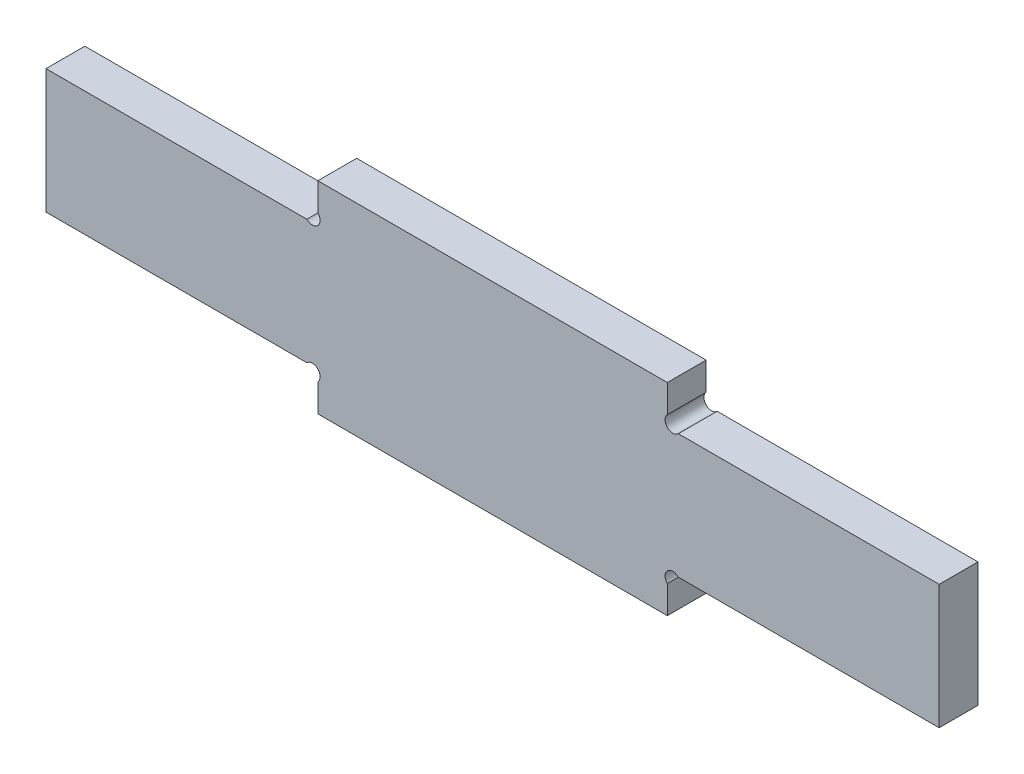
ISO-10303-21;
HEADER;
FILE_DESCRIPTION(('STEP AP214'),'2;1');
FILE_NAME('part.step','',(''),(''),'','','');
FILE_SCHEMA(('AUTOMOTIVE_DESIGN { 1 0 10303 214 1 1 1 1 }'));
ENDSEC;
DATA;
#1=APPLICATION_CONTEXT('core data for automotive mechanical design processes');
#2=APPLICATION_PROTOCOL_DEFINITION('international standard','automotive_design',2000,#1);
#3=PRODUCT_CONTEXT('',#1,'mechanical');
#4=PRODUCT('Part','Part','',(#3));
#5=PRODUCT_RELATED_PRODUCT_CATEGORY('part','',(#4));
#6=PRODUCT_DEFINITION_FORMATION('','',#4);
#7=PRODUCT_DEFINITION_CONTEXT('part definition',#1,'design');
#8=PRODUCT_DEFINITION('design','',#6,#7);
#9=PRODUCT_DEFINITION_SHAPE('','',#8);
#10=(LENGTH_UNIT() NAMED_UNIT(*) SI_UNIT(.MILLI.,.METRE.));
#11=(NAMED_UNIT(*) PLANE_ANGLE_UNIT() SI_UNIT($,.RADIAN.));
#12=(NAMED_UNIT(*) SI_UNIT($,.STERADIAN.) SOLID_ANGLE_UNIT());
#13=UNCERTAINTY_MEASURE_WITH_UNIT(LENGTH_MEASURE(1.E-05),#10,'distance_accuracy_value','');
#14=(GEOMETRIC_REPRESENTATION_CONTEXT(3) GLOBAL_UNCERTAINTY_ASSIGNED_CONTEXT((#13)) GLOBAL_UNIT_ASSIGNED_CONTEXT((#10,
#11,#12)) REPRESENTATION_CONTEXT('',''));
#15=CARTESIAN_POINT('',(0.,0.,0.));
#16=DIRECTION('',(0.,0.,1.));
#17=DIRECTION('',(1.,0.,0.));
#18=AXIS2_PLACEMENT_3D('',#15,#16,#17);
#19=CARTESIAN_POINT('',(0.,26.,5.));
#20=DIRECTION('',(0.,0.,-1.));
#21=DIRECTION('',(-1.,0.,0.));
#22=AXIS2_PLACEMENT_3D('',#19,#20,#21);
#23=PLANE('',#22);
#24=DIRECTION('',(0.,1.,0.));
#25=VECTOR('',#24,1.);
#26=CARTESIAN_POINT('',(80.,0.,5.));
#27=LINE('',#26,#25);
#28=CARTESIAN_POINT('',(80.,0.,5.));
#29=VERTEX_POINT('',#28);
#30=CARTESIAN_POINT('',(80.,3.58578643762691,5.));
#31=VERTEX_POINT('',#30);
#32=EDGE_CURVE('E49',#29,#31,#27,.T.);
#33=ORIENTED_EDGE('',*,*,#32,.T.);
#34=CARTESIAN_POINT('',(80.7071067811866,4.29289321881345,5.));
#35=DIRECTION('',(0.,0.,-1.));
#36=DIRECTION('',(-1.,0.,0.));
#37=AXIS2_PLACEMENT_3D('',#34,#35,#36);
#38=CIRCLE('',#37,1.00000000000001);
#39=CARTESIAN_POINT('',(81.4142135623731,5.,5.));
#40=VERTEX_POINT('',#39);
#41=EDGE_CURVE('E160',#31,#40,#38,.T.);
#42=ORIENTED_EDGE('',*,*,#41,.T.);
#43=DIRECTION('',(1.,0.,0.));
#44=VECTOR('',#43,1.);
#45=CARTESIAN_POINT('',(115.,5.,5.));
#46=LINE('',#45,#44);
#47=CARTESIAN_POINT('',(115.,5.,5.));
#48=VERTEX_POINT('',#47);
#49=EDGE_CURVE('E169',#40,#48,#46,.T.);
#50=ORIENTED_EDGE('',*,*,#49,.T.);
#51=DIRECTION('',(0.,-1.,0.));
#52=VECTOR('',#51,1.);
#53=CARTESIAN_POINT('',(115.,0.,5.));
#54=LINE('',#53,#52);
#55=CARTESIAN_POINT('',(115.,21.,5.));
#56=VERTEX_POINT('',#55);
#57=EDGE_CURVE('E197',#56,#48,#54,.T.);
#58=ORIENTED_EDGE('',*,*,#57,.F.);
#59=DIRECTION('',(-1.,0.,0.));
#60=VECTOR('',#59,1.);
#61=CARTESIAN_POINT('',(115.,21.,5.));
#62=LINE('',#61,#60);
#63=CARTESIAN_POINT('',(81.4142135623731,21.,5.));
#64=VERTEX_POINT('',#63);
#65=EDGE_CURVE('E57',#56,#64,#62,.T.);
#66=ORIENTED_EDGE('',*,*,#65,.T.);
#67=CARTESIAN_POINT('',(80.7071067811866,21.7071067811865,5.));
#68=DIRECTION('',(0.,0.,-1.));
#69=DIRECTION('',(-1.,0.,0.));
#70=AXIS2_PLACEMENT_3D('',#67,#68,#69);
#71=CIRCLE('',#70,0.999999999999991);
#72=CARTESIAN_POINT('',(80.,22.4142135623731,5.));
#73=VERTEX_POINT('',#72);
#74=EDGE_CURVE('E173',#64,#73,#71,.T.);
#75=ORIENTED_EDGE('',*,*,#74,.T.);
#76=DIRECTION('',(0.,1.,0.));
#77=VECTOR('',#76,1.);
#78=CARTESIAN_POINT('',(80.,26.,5.));
#79=LINE('',#78,#77);
#80=CARTESIAN_POINT('',(80.,26.,5.));
#81=VERTEX_POINT('',#80);
#82=EDGE_CURVE('E188',#73,#81,#79,.T.);
#83=ORIENTED_EDGE('',*,*,#82,.T.);
#84=DIRECTION('',(-1.,0.,0.));
#85=VECTOR('',#84,1.);
#86=CARTESIAN_POINT('',(0.,26.,5.));
#87=LINE('',#86,#85);
#88=CARTESIAN_POINT('',(35.,26.,5.));
#89=VERTEX_POINT('',#88);
#90=EDGE_CURVE('E11',#81,#89,#87,.T.);
#91=ORIENTED_EDGE('',*,*,#90,.T.);
#92=DIRECTION('',(0.,1.,0.));
#93=VECTOR('',#92,1.);
#94=CARTESIAN_POINT('',(35.,26.,5.));
#95=LINE('',#94,#93);
#96=CARTESIAN_POINT('',(35.,22.4142135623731,5.));
#97=VERTEX_POINT('',#96);
#98=EDGE_CURVE('E240',#97,#89,#95,.T.);
#99=ORIENTED_EDGE('',*,*,#98,.F.);
#100=CARTESIAN_POINT('',(34.2928932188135,21.7071067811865,5.));
#101=DIRECTION('',(0.,0.,1.));
#102=DIRECTION('',(1.,0.,0.));
#103=AXIS2_PLACEMENT_3D('',#100,#101,#102);
#104=CIRCLE('',#103,0.999999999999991);
#105=CARTESIAN_POINT('',(33.5857864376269,21.,5.));
#106=VERTEX_POINT('',#105);
#107=EDGE_CURVE('E215',#106,#97,#104,.T.);
#108=ORIENTED_EDGE('',*,*,#107,.F.);
#109=DIRECTION('',(1.,0.,0.));
#110=VECTOR('',#109,1.);
#111=CARTESIAN_POINT('',(0.,21.,5.));
#112=LINE('',#111,#110);
#113=CARTESIAN_POINT('',(0.,21.,5.));
#114=VERTEX_POINT('',#113);
#115=EDGE_CURVE('E237',#114,#106,#112,.T.);
#116=ORIENTED_EDGE('',*,*,#115,.F.);
#117=DIRECTION('',(0.,-1.,0.));
#118=VECTOR('',#117,1.);
#119=CARTESIAN_POINT('',(0.,0.,5.));
#120=LINE('',#119,#118);
#121=CARTESIAN_POINT('',(0.,5.,5.));
#122=VERTEX_POINT('',#121);
#123=EDGE_CURVE('E252',#114,#122,#120,.T.);
#124=ORIENTED_EDGE('',*,*,#123,.T.);
#125=DIRECTION('',(-1.,0.,0.));
#126=VECTOR('',#125,1.);
#127=CARTESIAN_POINT('',(0.,5.,5.));
#128=LINE('',#127,#126);
#129=CARTESIAN_POINT('',(33.5857864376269,5.,5.));
#130=VERTEX_POINT('',#129);
#131=EDGE_CURVE('E227',#130,#122,#128,.T.);
#132=ORIENTED_EDGE('',*,*,#131,.F.);
#133=CARTESIAN_POINT('',(34.2928932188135,4.29289321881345,5.));
#134=DIRECTION('',(0.,0.,1.));
#135=DIRECTION('',(1.,0.,0.));
#136=AXIS2_PLACEMENT_3D('',#133,#134,#135);
#137=CIRCLE('',#136,1.00000000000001);
#138=CARTESIAN_POINT('',(35.,3.5857864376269,5.));
#139=VERTEX_POINT('',#138);
#140=EDGE_CURVE('E209',#139,#130,#137,.T.);
#141=ORIENTED_EDGE('',*,*,#140,.F.);
#142=DIRECTION('',(0.,1.,0.));
#143=VECTOR('',#142,1.);
#144=CARTESIAN_POINT('',(35.,0.,5.));
#145=LINE('',#144,#143);
#146=CARTESIAN_POINT('',(35.,0.,5.));
#147=VERTEX_POINT('',#146);
#148=EDGE_CURVE('E224',#147,#139,#145,.T.);
#149=ORIENTED_EDGE('',*,*,#148,.F.);
#150=DIRECTION('',(1.,0.,0.));
#151=VECTOR('',#150,1.);
#152=CARTESIAN_POINT('',(0.,0.,5.));
#153=LINE('',#152,#151);
#154=EDGE_CURVE('E41',#147,#29,#153,.T.);
#155=ORIENTED_EDGE('',*,*,#154,.T.);
#156=EDGE_LOOP('',(#33,#42,#50,#58,#66,#75,#83,#91,#99,#108,#116,#124,#132,#141,#149,#155));
#157=FACE_BOUND('',#156,.T.);
#158=ADVANCED_FACE('F32',(#157),#23,.F.);
#159=CARTESIAN_POINT('',(0.,26.,0.));
#160=DIRECTION('',(0.,0.,-1.));
#161=DIRECTION('',(-1.,0.,0.));
#162=AXIS2_PLACEMENT_3D('',#159,#160,#161);
#163=PLANE('',#162);
#164=CARTESIAN_POINT('',(80.7071067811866,4.29289321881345,0.));
#165=DIRECTION('',(0.,0.,-1.));
#166=DIRECTION('',(-1.,0.,0.));
#167=AXIS2_PLACEMENT_3D('',#164,#165,#166);
#168=CIRCLE('',#167,1.00000000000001);
#169=CARTESIAN_POINT('',(80.,3.58578643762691,0.));
#170=VERTEX_POINT('',#169);
#171=CARTESIAN_POINT('',(81.4142135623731,5.,0.));
#172=VERTEX_POINT('',#171);
#173=EDGE_CURVE('E148',#170,#172,#168,.T.);
#174=ORIENTED_EDGE('',*,*,#173,.F.);
#175=DIRECTION('',(0.,1.,0.));
#176=VECTOR('',#175,1.);
#177=CARTESIAN_POINT('',(80.,0.,0.));
#178=LINE('',#177,#176);
#179=CARTESIAN_POINT('',(80.,0.,0.));
#180=VERTEX_POINT('',#179);
#181=EDGE_CURVE('E153',#180,#170,#178,.T.);
#182=ORIENTED_EDGE('',*,*,#181,.F.);
#183=DIRECTION('',(1.,0.,0.));
#184=VECTOR('',#183,1.);
#185=CARTESIAN_POINT('',(0.,0.,0.));
#186=LINE('',#185,#184);
#187=CARTESIAN_POINT('',(35.,0.,0.));
#188=VERTEX_POINT('',#187);
#189=EDGE_CURVE('E258',#188,#180,#186,.T.);
#190=ORIENTED_EDGE('',*,*,#189,.F.);
#191=DIRECTION('',(0.,1.,0.));
#192=VECTOR('',#191,1.);
#193=CARTESIAN_POINT('',(35.,0.,0.));
#194=LINE('',#193,#192);
#195=CARTESIAN_POINT('',(35.,3.5857864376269,0.));
#196=VERTEX_POINT('',#195);
#197=EDGE_CURVE('E219',#188,#196,#194,.T.);
#198=ORIENTED_EDGE('',*,*,#197,.T.);
#199=CARTESIAN_POINT('',(34.2928932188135,4.29289321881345,0.));
#200=DIRECTION('',(0.,0.,-1.));
#201=DIRECTION('',(-1.,0.,0.));
#202=AXIS2_PLACEMENT_3D('',#199,#200,#201);
#203=CIRCLE('',#202,1.00000000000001);
#204=CARTESIAN_POINT('',(33.5857864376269,5.,0.));
#205=VERTEX_POINT('',#204);
#206=EDGE_CURVE('E211',#196,#205,#203,.F.);
#207=ORIENTED_EDGE('',*,*,#206,.T.);
#208=DIRECTION('',(-1.,0.,0.));
#209=VECTOR('',#208,1.);
#210=CARTESIAN_POINT('',(0.,5.,0.));
#211=LINE('',#210,#209);
#212=CARTESIAN_POINT('',(0.,5.,0.));
#213=VERTEX_POINT('',#212);
#214=EDGE_CURVE('E222',#205,#213,#211,.T.);
#215=ORIENTED_EDGE('',*,*,#214,.T.);
#216=DIRECTION('',(0.,-1.,0.));
#217=VECTOR('',#216,1.);
#218=CARTESIAN_POINT('',(0.,0.,0.));
#219=LINE('',#218,#217);
#220=CARTESIAN_POINT('',(0.,21.,0.));
#221=VERTEX_POINT('',#220);
#222=EDGE_CURVE('E251',#221,#213,#219,.T.);
#223=ORIENTED_EDGE('',*,*,#222,.F.);
#224=DIRECTION('',(1.,0.,0.));
#225=VECTOR('',#224,1.);
#226=CARTESIAN_POINT('',(0.,21.,0.));
#227=LINE('',#226,#225);
#228=CARTESIAN_POINT('',(33.5857864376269,21.,0.));
#229=VERTEX_POINT('',#228);
#230=EDGE_CURVE('E247',#221,#229,#227,.T.);
#231=ORIENTED_EDGE('',*,*,#230,.T.);
#232=CARTESIAN_POINT('',(34.2928932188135,21.7071067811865,0.));
#233=DIRECTION('',(0.,0.,-1.));
#234=DIRECTION('',(-1.,0.,0.));
#235=AXIS2_PLACEMENT_3D('',#232,#233,#234);
#236=CIRCLE('',#235,0.999999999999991);
#237=CARTESIAN_POINT('',(35.,22.4142135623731,0.));
#238=VERTEX_POINT('',#237);
#239=EDGE_CURVE('E217',#229,#238,#236,.F.);
#240=ORIENTED_EDGE('',*,*,#239,.T.);
#241=DIRECTION('',(0.,1.,0.));
#242=VECTOR('',#241,1.);
#243=CARTESIAN_POINT('',(35.,26.,0.));
#244=LINE('',#243,#242);
#245=CARTESIAN_POINT('',(35.,26.,0.));
#246=VERTEX_POINT('',#245);
#247=EDGE_CURVE('E233',#238,#246,#244,.T.);
#248=ORIENTED_EDGE('',*,*,#247,.T.);
#249=DIRECTION('',(-1.,0.,0.));
#250=VECTOR('',#249,1.);
#251=CARTESIAN_POINT('',(0.,26.,0.));
#252=LINE('',#251,#250);
#253=CARTESIAN_POINT('',(80.,26.,0.));
#254=VERTEX_POINT('',#253);
#255=EDGE_CURVE('E36',#254,#246,#252,.T.);
#256=ORIENTED_EDGE('',*,*,#255,.F.);
#257=DIRECTION('',(0.,1.,0.));
#258=VECTOR('',#257,1.);
#259=CARTESIAN_POINT('',(80.,26.,0.));
#260=LINE('',#259,#258);
#261=CARTESIAN_POINT('',(80.,22.4142135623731,0.));
#262=VERTEX_POINT('',#261);
#263=EDGE_CURVE('E183',#262,#254,#260,.T.);
#264=ORIENTED_EDGE('',*,*,#263,.F.);
#265=CARTESIAN_POINT('',(80.7071067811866,21.7071067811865,0.));
#266=DIRECTION('',(0.,0.,-1.));
#267=DIRECTION('',(-1.,0.,0.));
#268=AXIS2_PLACEMENT_3D('',#265,#266,#267);
#269=CIRCLE('',#268,0.999999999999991);
#270=CARTESIAN_POINT('',(81.4142135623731,21.,0.));
#271=VERTEX_POINT('',#270);
#272=EDGE_CURVE('E170',#271,#262,#269,.T.);
#273=ORIENTED_EDGE('',*,*,#272,.F.);
#274=DIRECTION('',(-1.,0.,0.));
#275=VECTOR('',#274,1.);
#276=CARTESIAN_POINT('',(115.,21.,0.));
#277=LINE('',#276,#275);
#278=CARTESIAN_POINT('',(115.,21.,0.));
#279=VERTEX_POINT('',#278);
#280=EDGE_CURVE('E185',#279,#271,#277,.T.);
#281=ORIENTED_EDGE('',*,*,#280,.F.);
#282=DIRECTION('',(0.,-1.,0.));
#283=VECTOR('',#282,1.);
#284=CARTESIAN_POINT('',(115.,0.,0.));
#285=LINE('',#284,#283);
#286=CARTESIAN_POINT('',(115.,5.,0.));
#287=VERTEX_POINT('',#286);
#288=EDGE_CURVE('E194',#279,#287,#285,.T.);
#289=ORIENTED_EDGE('',*,*,#288,.T.);
#290=DIRECTION('',(1.,0.,0.));
#291=VECTOR('',#290,1.);
#292=CARTESIAN_POINT('',(115.,5.,0.));
#293=LINE('',#292,#291);
#294=EDGE_CURVE('E156',#172,#287,#293,.T.);
#295=ORIENTED_EDGE('',*,*,#294,.F.);
#296=EDGE_LOOP('',(#174,#182,#190,#198,#207,#215,#223,#231,#240,#248,#256,#264,#273,#281,#289,#295));
#297=FACE_BOUND('',#296,.T.);
#298=ADVANCED_FACE('F150',(#297),#163,.T.);
#299=CARTESIAN_POINT('',(80.,0.,-0.00100000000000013));
#300=DIRECTION('',(1.,0.,0.));
#301=DIRECTION('',(0.,0.,-1.));
#302=AXIS2_PLACEMENT_3D('',#299,#300,#301);
#303=PLANE('',#302);
#304=ORIENTED_EDGE('',*,*,#181,.T.);
#305=DIRECTION('',(0.,0.,1.));
#306=VECTOR('',#305,1.);
#307=CARTESIAN_POINT('',(80.,3.58578643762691,-0.00100000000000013));
#308=LINE('',#307,#306);
#309=EDGE_CURVE('E162',#31,#170,#308,.F.);
#310=ORIENTED_EDGE('',*,*,#309,.F.);
#311=ORIENTED_EDGE('',*,*,#32,.F.);
#312=DIRECTION('',(0.,0.,1.));
#313=VECTOR('',#312,1.);
#314=CARTESIAN_POINT('',(80.,0.,-0.00100000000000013));
#315=LINE('',#314,#313);
#316=EDGE_CURVE('E168',#180,#29,#315,.T.);
#317=ORIENTED_EDGE('',*,*,#316,.F.);
#318=EDGE_LOOP('',(#304,#310,#311,#317));
#319=FACE_BOUND('',#318,.T.);
#320=ADVANCED_FACE('F167',(#319),#303,.T.);
#321=CARTESIAN_POINT('',(115.,21.,-0.00100000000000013));
#322=DIRECTION('',(0.,1.,0.));
#323=DIRECTION('',(0.,0.,1.));
#324=AXIS2_PLACEMENT_3D('',#321,#322,#323);
#325=PLANE('',#324);
#326=ORIENTED_EDGE('',*,*,#280,.T.);
#327=DIRECTION('',(0.,0.,1.));
#328=VECTOR('',#327,1.);
#329=CARTESIAN_POINT('',(81.4142135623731,21.,-0.00100000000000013));
#330=LINE('',#329,#328);
#331=EDGE_CURVE('E165',#64,#271,#330,.F.);
#332=ORIENTED_EDGE('',*,*,#331,.F.);
#333=ORIENTED_EDGE('',*,*,#65,.F.);
#334=DIRECTION('',(0.,0.,1.));
#335=VECTOR('',#334,1.);
#336=CARTESIAN_POINT('',(115.,21.,-0.00100000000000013));
#337=LINE('',#336,#335);
#338=EDGE_CURVE('E192',#279,#56,#337,.T.);
#339=ORIENTED_EDGE('',*,*,#338,.F.);
#340=EDGE_LOOP('',(#326,#332,#333,#339));
#341=FACE_BOUND('',#340,.T.);
#342=ADVANCED_FACE('F288',(#341),#325,.T.);
#343=CARTESIAN_POINT('',(115.,5.,-0.00100000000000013));
#344=DIRECTION('',(0.,-1.,0.));
#345=DIRECTION('',(0.,0.,-1.));
#346=AXIS2_PLACEMENT_3D('',#343,#344,#345);
#347=PLANE('',#346);
#348=ORIENTED_EDGE('',*,*,#49,.F.);
#349=DIRECTION('',(0.,0.,1.));
#350=VECTOR('',#349,1.);
#351=CARTESIAN_POINT('',(81.4142135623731,5.,-0.00100000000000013));
#352=LINE('',#351,#350);
#353=EDGE_CURVE('E286',#172,#40,#352,.T.);
#354=ORIENTED_EDGE('',*,*,#353,.F.);
#355=ORIENTED_EDGE('',*,*,#294,.T.);
#356=DIRECTION('',(0.,0.,1.));
#357=VECTOR('',#356,1.);
#358=CARTESIAN_POINT('',(115.,5.,-0.00100000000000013));
#359=LINE('',#358,#357);
#360=EDGE_CURVE('E178',#287,#48,#359,.T.);
#361=ORIENTED_EDGE('',*,*,#360,.T.);
#362=EDGE_LOOP('',(#348,#354,#355,#361));
#363=FACE_BOUND('',#362,.T.);
#364=ADVANCED_FACE('F295',(#363),#347,.T.);
#365=CARTESIAN_POINT('',(80.,26.,-0.00100000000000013));
#366=DIRECTION('',(1.,0.,0.));
#367=DIRECTION('',(0.,0.,-1.));
#368=AXIS2_PLACEMENT_3D('',#365,#366,#367);
#369=PLANE('',#368);
#370=ORIENTED_EDGE('',*,*,#82,.F.);
#371=DIRECTION('',(0.,0.,1.));
#372=VECTOR('',#371,1.);
#373=CARTESIAN_POINT('',(80.,22.4142135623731,-0.00100000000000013));
#374=LINE('',#373,#372);
#375=EDGE_CURVE('E159',#262,#73,#374,.T.);
#376=ORIENTED_EDGE('',*,*,#375,.F.);
#377=ORIENTED_EDGE('',*,*,#263,.T.);
#378=DIRECTION('',(0.,0.,1.));
#379=VECTOR('',#378,1.);
#380=CARTESIAN_POINT('',(80.,26.,-0.00100000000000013));
#381=LINE('',#380,#379);
#382=EDGE_CURVE('E191',#254,#81,#381,.T.);
#383=ORIENTED_EDGE('',*,*,#382,.T.);
#384=EDGE_LOOP('',(#370,#376,#377,#383));
#385=FACE_BOUND('',#384,.T.);
#386=ADVANCED_FACE('F280',(#385),#369,.T.);
#387=CARTESIAN_POINT('',(115.,0.,5.));
#388=DIRECTION('',(1.,0.,0.));
#389=DIRECTION('',(0.,0.,-1.));
#390=AXIS2_PLACEMENT_3D('',#387,#388,#389);
#391=PLANE('',#390);
#392=ORIENTED_EDGE('',*,*,#57,.T.);
#393=ORIENTED_EDGE('',*,*,#360,.F.);
#394=ORIENTED_EDGE('',*,*,#288,.F.);
#395=ORIENTED_EDGE('',*,*,#338,.T.);
#396=EDGE_LOOP('',(#392,#393,#394,#395));
#397=FACE_BOUND('',#396,.T.);
#398=ADVANCED_FACE('F291',(#397),#391,.T.);
#399=CARTESIAN_POINT('',(0.,0.,5.));
#400=DIRECTION('',(0.,1.,0.));
#401=DIRECTION('',(0.,0.,1.));
#402=AXIS2_PLACEMENT_3D('',#399,#400,#401);
#403=PLANE('',#402);
#404=ORIENTED_EDGE('',*,*,#316,.T.);
#405=ORIENTED_EDGE('',*,*,#154,.F.);
#406=DIRECTION('',(0.,0.,1.));
#407=VECTOR('',#406,1.);
#408=CARTESIAN_POINT('',(35.,0.,-0.00100000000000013));
#409=LINE('',#408,#407);
#410=EDGE_CURVE('E229',#188,#147,#409,.T.);
#411=ORIENTED_EDGE('',*,*,#410,.F.);
#412=ORIENTED_EDGE('',*,*,#189,.T.);
#413=EDGE_LOOP('',(#404,#405,#411,#412));
#414=FACE_BOUND('',#413,.T.);
#415=ADVANCED_FACE('F319',(#414),#403,.F.);
#416=CARTESIAN_POINT('',(0.,26.,5.));
#417=DIRECTION('',(0.,-1.,0.));
#418=DIRECTION('',(0.,0.,-1.));
#419=AXIS2_PLACEMENT_3D('',#416,#417,#418);
#420=PLANE('',#419);
#421=ORIENTED_EDGE('',*,*,#382,.F.);
#422=ORIENTED_EDGE('',*,*,#255,.T.);
#423=DIRECTION('',(0.,0.,1.));
#424=VECTOR('',#423,1.);
#425=CARTESIAN_POINT('',(35.,26.,-0.00100000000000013));
#426=LINE('',#425,#424);
#427=EDGE_CURVE('E244',#246,#89,#426,.T.);
#428=ORIENTED_EDGE('',*,*,#427,.T.);
#429=ORIENTED_EDGE('',*,*,#90,.F.);
#430=EDGE_LOOP('',(#421,#422,#428,#429));
#431=FACE_BOUND('',#430,.T.);
#432=ADVANCED_FACE('F264',(#431),#420,.F.);
#433=CARTESIAN_POINT('',(0.,0.,5.));
#434=DIRECTION('',(1.,0.,0.));
#435=DIRECTION('',(0.,0.,-1.));
#436=AXIS2_PLACEMENT_3D('',#433,#434,#435);
#437=PLANE('',#436);
#438=ORIENTED_EDGE('',*,*,#222,.T.);
#439=DIRECTION('',(0.,0.,1.));
#440=VECTOR('',#439,1.);
#441=CARTESIAN_POINT('',(0.,5.,-0.00100000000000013));
#442=LINE('',#441,#440);
#443=EDGE_CURVE('E230',#213,#122,#442,.T.);
#444=ORIENTED_EDGE('',*,*,#443,.T.);
#445=ORIENTED_EDGE('',*,*,#123,.F.);
#446=DIRECTION('',(0.,0.,1.));
#447=VECTOR('',#446,1.);
#448=CARTESIAN_POINT('',(0.,21.,-0.00100000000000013));
#449=LINE('',#448,#447);
#450=EDGE_CURVE('E243',#221,#114,#449,.T.);
#451=ORIENTED_EDGE('',*,*,#450,.F.);
#452=EDGE_LOOP('',(#438,#444,#445,#451));
#453=FACE_BOUND('',#452,.T.);
#454=ADVANCED_FACE('F34',(#453),#437,.F.);
#455=CARTESIAN_POINT('',(35.,26.,-0.00100000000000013));
#456=DIRECTION('',(1.,0.,0.));
#457=DIRECTION('',(0.,0.,-1.));
#458=AXIS2_PLACEMENT_3D('',#455,#456,#457);
#459=PLANE('',#458);
#460=ORIENTED_EDGE('',*,*,#247,.F.);
#461=DIRECTION('',(0.,0.,1.));
#462=VECTOR('',#461,1.);
#463=CARTESIAN_POINT('',(35.,22.4142135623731,-0.00100000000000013));
#464=LINE('',#463,#462);
#465=EDGE_CURVE('E204',#97,#238,#464,.F.);
#466=ORIENTED_EDGE('',*,*,#465,.F.);
#467=ORIENTED_EDGE('',*,*,#98,.T.);
#468=ORIENTED_EDGE('',*,*,#427,.F.);
#469=EDGE_LOOP('',(#460,#466,#467,#468));
#470=FACE_BOUND('',#469,.T.);
#471=ADVANCED_FACE('F271',(#470),#459,.F.);
#472=CARTESIAN_POINT('',(0.,21.,-0.00100000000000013));
#473=DIRECTION('',(0.,-1.,0.));
#474=DIRECTION('',(0.,0.,-1.));
#475=AXIS2_PLACEMENT_3D('',#472,#473,#474);
#476=PLANE('',#475);
#477=ORIENTED_EDGE('',*,*,#115,.T.);
#478=DIRECTION('',(0.,0.,1.));
#479=VECTOR('',#478,1.);
#480=CARTESIAN_POINT('',(33.5857864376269,21.,-0.00100000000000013));
#481=LINE('',#480,#479);
#482=EDGE_CURVE('E213',#229,#106,#481,.T.);
#483=ORIENTED_EDGE('',*,*,#482,.F.);
#484=ORIENTED_EDGE('',*,*,#230,.F.);
#485=ORIENTED_EDGE('',*,*,#450,.T.);
#486=EDGE_LOOP('',(#477,#483,#484,#485));
#487=FACE_BOUND('',#486,.T.);
#488=ADVANCED_FACE('F315',(#487),#476,.F.);
#489=CARTESIAN_POINT('',(0.,5.,-0.00100000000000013));
#490=DIRECTION('',(0.,1.,0.));
#491=DIRECTION('',(0.,0.,1.));
#492=AXIS2_PLACEMENT_3D('',#489,#490,#491);
#493=PLANE('',#492);
#494=ORIENTED_EDGE('',*,*,#214,.F.);
#495=DIRECTION('',(0.,0.,1.));
#496=VECTOR('',#495,1.);
#497=CARTESIAN_POINT('',(33.5857864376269,5.,-0.00100000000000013));
#498=LINE('',#497,#496);
#499=EDGE_CURVE('E200',#130,#205,#498,.F.);
#500=ORIENTED_EDGE('',*,*,#499,.F.);
#501=ORIENTED_EDGE('',*,*,#131,.T.);
#502=ORIENTED_EDGE('',*,*,#443,.F.);
#503=EDGE_LOOP('',(#494,#500,#501,#502));
#504=FACE_BOUND('',#503,.T.);
#505=ADVANCED_FACE('F339',(#504),#493,.F.);
#506=CARTESIAN_POINT('',(35.,0.,-0.00100000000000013));
#507=DIRECTION('',(1.,0.,0.));
#508=DIRECTION('',(0.,0.,-1.));
#509=AXIS2_PLACEMENT_3D('',#506,#507,#508);
#510=PLANE('',#509);
#511=ORIENTED_EDGE('',*,*,#148,.T.);
#512=DIRECTION('',(0.,0.,1.));
#513=VECTOR('',#512,1.);
#514=CARTESIAN_POINT('',(35.,3.5857864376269,-0.00100000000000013));
#515=LINE('',#514,#513);
#516=EDGE_CURVE('E207',#196,#139,#515,.T.);
#517=ORIENTED_EDGE('',*,*,#516,.F.);
#518=ORIENTED_EDGE('',*,*,#197,.F.);
#519=ORIENTED_EDGE('',*,*,#410,.T.);
#520=EDGE_LOOP('',(#511,#517,#518,#519));
#521=FACE_BOUND('',#520,.T.);
#522=ADVANCED_FACE('F331',(#521),#510,.F.);
#523=CARTESIAN_POINT('',(34.2928932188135,21.7071067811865,-0.00100000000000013));
#524=DIRECTION('',(0.,0.,1.));
#525=DIRECTION('',(1.,0.,0.));
#526=AXIS2_PLACEMENT_3D('',#523,#524,#525);
#527=CYLINDRICAL_SURFACE('',#526,0.999999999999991);
#528=ORIENTED_EDGE('',*,*,#107,.T.);
#529=ORIENTED_EDGE('',*,*,#465,.T.);
#530=ORIENTED_EDGE('',*,*,#239,.F.);
#531=ORIENTED_EDGE('',*,*,#482,.T.);
#532=EDGE_LOOP('',(#528,#529,#530,#531));
#533=FACE_BOUND('',#532,.T.);
#534=ADVANCED_FACE('F346',(#533),#527,.F.);
#535=CARTESIAN_POINT('',(34.2928932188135,4.29289321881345,-0.00100000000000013));
#536=DIRECTION('',(0.,0.,1.));
#537=DIRECTION('',(1.,0.,0.));
#538=AXIS2_PLACEMENT_3D('',#535,#536,#537);
#539=CYLINDRICAL_SURFACE('',#538,1.00000000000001);
#540=ORIENTED_EDGE('',*,*,#140,.T.);
#541=ORIENTED_EDGE('',*,*,#499,.T.);
#542=ORIENTED_EDGE('',*,*,#206,.F.);
#543=ORIENTED_EDGE('',*,*,#516,.T.);
#544=EDGE_LOOP('',(#540,#541,#542,#543));
#545=FACE_BOUND('',#544,.T.);
#546=ADVANCED_FACE('F337',(#545),#539,.F.);
#547=CARTESIAN_POINT('',(80.7071067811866,21.7071067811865,-0.00100000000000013));
#548=DIRECTION('',(0.,0.,1.));
#549=DIRECTION('',(1.,0.,0.));
#550=AXIS2_PLACEMENT_3D('',#547,#548,#549);
#551=CYLINDRICAL_SURFACE('',#550,0.999999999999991);
#552=ORIENTED_EDGE('',*,*,#375,.T.);
#553=ORIENTED_EDGE('',*,*,#74,.F.);
#554=ORIENTED_EDGE('',*,*,#331,.T.);
#555=ORIENTED_EDGE('',*,*,#272,.T.);
#556=EDGE_LOOP('',(#552,#553,#554,#555));
#557=FACE_BOUND('',#556,.T.);
#558=ADVANCED_FACE('F285',(#557),#551,.F.);
#559=CARTESIAN_POINT('',(80.7071067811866,4.29289321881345,-0.00100000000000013));
#560=DIRECTION('',(0.,0.,1.));
#561=DIRECTION('',(1.,0.,0.));
#562=AXIS2_PLACEMENT_3D('',#559,#560,#561);
#563=CYLINDRICAL_SURFACE('',#562,1.00000000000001);
#564=ORIENTED_EDGE('',*,*,#173,.T.);
#565=ORIENTED_EDGE('',*,*,#353,.T.);
#566=ORIENTED_EDGE('',*,*,#41,.F.);
#567=ORIENTED_EDGE('',*,*,#309,.T.);
#568=EDGE_LOOP('',(#564,#565,#566,#567));
#569=FACE_BOUND('',#568,.T.);
#570=ADVANCED_FACE('F163',(#569),#563,.F.);
#571=CLOSED_SHELL('',(#158,#298,#320,#342,#364,#386,#398,#415,#432,#454,#471,#488,#505,#522,
#534,#546,#558,#570));
#572=MANIFOLD_SOLID_BREP('B2',#571);
#573=ADVANCED_BREP_SHAPE_REPRESENTATION('',(#18,#572),#14);
#574=SHAPE_DEFINITION_REPRESENTATION(#9,#573);
ENDSEC;
END-ISO-10303-21;
